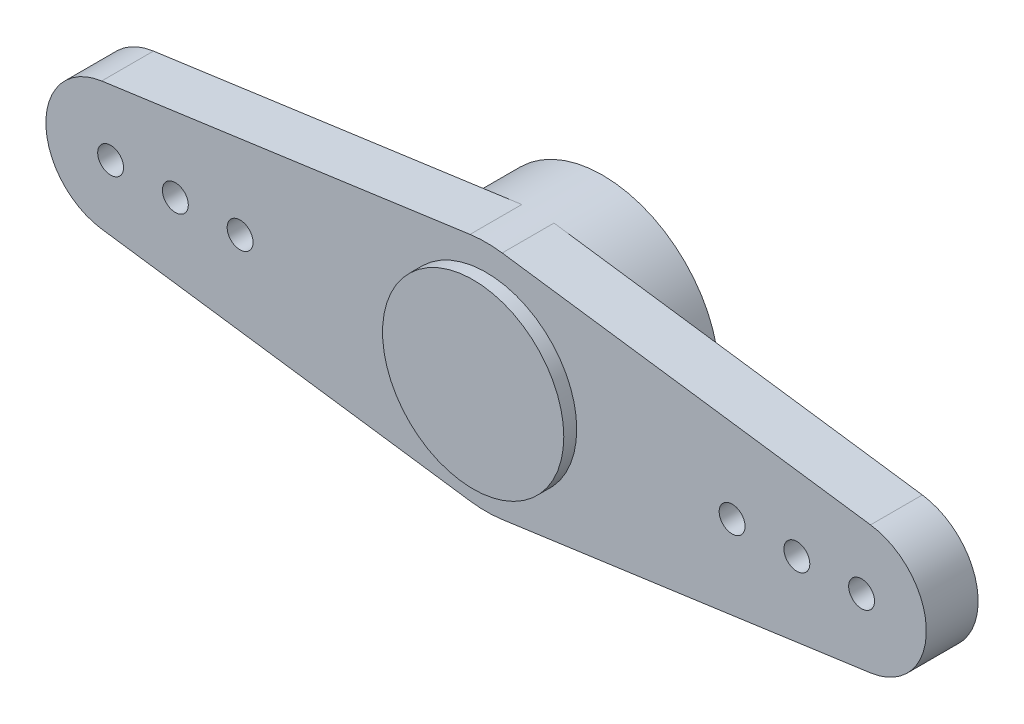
ISO-10303-21;
HEADER;
FILE_DESCRIPTION(('STEP AP214'),'2;1');
FILE_NAME('part.step','',(''),(''),'','','');
FILE_SCHEMA(('AUTOMOTIVE_DESIGN { 1 0 10303 214 1 1 1 1 }'));
ENDSEC;
DATA;
#1=APPLICATION_CONTEXT('core data for automotive mechanical design processes');
#2=APPLICATION_PROTOCOL_DEFINITION('international standard','automotive_design',2000,#1);
#3=PRODUCT_CONTEXT('',#1,'mechanical');
#4=PRODUCT('Part','Part','',(#3));
#5=PRODUCT_RELATED_PRODUCT_CATEGORY('part','',(#4));
#6=PRODUCT_DEFINITION_FORMATION('','',#4);
#7=PRODUCT_DEFINITION_CONTEXT('part definition',#1,'design');
#8=PRODUCT_DEFINITION('design','',#6,#7);
#9=PRODUCT_DEFINITION_SHAPE('','',#8);
#10=(LENGTH_UNIT() NAMED_UNIT(*) SI_UNIT(.MILLI.,.METRE.));
#11=(NAMED_UNIT(*) PLANE_ANGLE_UNIT() SI_UNIT($,.RADIAN.));
#12=(NAMED_UNIT(*) SI_UNIT($,.STERADIAN.) SOLID_ANGLE_UNIT());
#13=UNCERTAINTY_MEASURE_WITH_UNIT(LENGTH_MEASURE(1.E-05),#10,'distance_accuracy_value','');
#14=(GEOMETRIC_REPRESENTATION_CONTEXT(3) GLOBAL_UNCERTAINTY_ASSIGNED_CONTEXT((#13)) GLOBAL_UNIT_ASSIGNED_CONTEXT((#10,
#11,#12)) REPRESENTATION_CONTEXT('',''));
#15=CARTESIAN_POINT('',(0.,0.,0.));
#16=DIRECTION('',(0.,0.,1.));
#17=DIRECTION('',(1.,0.,0.));
#18=AXIS2_PLACEMENT_3D('',#15,#16,#17);
#19=CARTESIAN_POINT('',(0.,0.,0.));
#20=DIRECTION('',(0.,0.,1.));
#21=DIRECTION('',(1.,0.,0.));
#22=AXIS2_PLACEMENT_3D('',#19,#20,#21);
#23=PLANE('',#22);
#24=CARTESIAN_POINT('',(14.5,0.,0.));
#25=DIRECTION('',(0.,0.,1.));
#26=DIRECTION('',(1.,0.,0.));
#27=AXIS2_PLACEMENT_3D('',#24,#25,#26);
#28=CIRCLE('',#27,0.500000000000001);
#29=CARTESIAN_POINT('',(15.,0.,0.));
#30=VERTEX_POINT('',#29);
#31=EDGE_CURVE('E426',#30,#30,#28,.T.);
#32=ORIENTED_EDGE('',*,*,#31,.T.);
#33=EDGE_LOOP('',(#32));
#34=FACE_BOUND('',#33,.T.);
#35=CARTESIAN_POINT('',(9.5,0.,0.));
#36=DIRECTION('',(0.,0.,1.));
#37=DIRECTION('',(1.,0.,0.));
#38=AXIS2_PLACEMENT_3D('',#35,#36,#37);
#39=CIRCLE('',#38,0.500000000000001);
#40=CARTESIAN_POINT('',(10.,0.,0.));
#41=VERTEX_POINT('',#40);
#42=EDGE_CURVE('E437',#41,#41,#39,.T.);
#43=ORIENTED_EDGE('',*,*,#42,.T.);
#44=EDGE_LOOP('',(#43));
#45=FACE_BOUND('',#44,.T.);
#46=CARTESIAN_POINT('',(12.,0.,0.));
#47=DIRECTION('',(0.,0.,1.));
#48=DIRECTION('',(1.,0.,0.));
#49=AXIS2_PLACEMENT_3D('',#46,#47,#48);
#50=CIRCLE('',#49,0.500000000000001);
#51=CARTESIAN_POINT('',(12.5,0.,0.));
#52=VERTEX_POINT('',#51);
#53=EDGE_CURVE('E432',#52,#52,#50,.T.);
#54=ORIENTED_EDGE('',*,*,#53,.T.);
#55=EDGE_LOOP('',(#54));
#56=FACE_BOUND('',#55,.T.);
#57=CARTESIAN_POINT('',(0.,0.,0.));
#58=DIRECTION('',(0.,0.,-1.));
#59=DIRECTION('',(-1.,0.,0.));
#60=AXIS2_PLACEMENT_3D('',#57,#58,#59);
#61=CIRCLE('',#60,4.5);
#62=CARTESIAN_POINT('',(0.620689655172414,4.45698826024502,0.));
#63=VERTEX_POINT('',#62);
#64=CARTESIAN_POINT('',(0.620689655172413,-4.45698826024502,0.));
#65=VERTEX_POINT('',#64);
#66=EDGE_CURVE('E11',#63,#65,#61,.T.);
#67=ORIENTED_EDGE('',*,*,#66,.F.);
#68=DIRECTION('',(-0.990441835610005,0.137931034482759,0.));
#69=VECTOR('',#68,1.);
#70=CARTESIAN_POINT('',(0.620689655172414,4.45698826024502,0.));
#71=LINE('',#70,#69);
#72=CARTESIAN_POINT('',(14.8448275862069,2.47610458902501,0.));
#73=VERTEX_POINT('',#72);
#74=EDGE_CURVE('E136',#73,#63,#71,.T.);
#75=ORIENTED_EDGE('',*,*,#74,.F.);
#76=CARTESIAN_POINT('',(14.5,0.,0.));
#77=DIRECTION('',(0.,0.,1.));
#78=DIRECTION('',(1.,0.,0.));
#79=AXIS2_PLACEMENT_3D('',#76,#77,#78);
#80=CIRCLE('',#79,2.5);
#81=CARTESIAN_POINT('',(14.8448275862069,-2.47610458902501,0.));
#82=VERTEX_POINT('',#81);
#83=EDGE_CURVE('E134',#82,#73,#80,.T.);
#84=ORIENTED_EDGE('',*,*,#83,.F.);
#85=DIRECTION('',(0.990441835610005,0.137931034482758,0.));
#86=VECTOR('',#85,1.);
#87=CARTESIAN_POINT('',(14.8448275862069,-2.47610458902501,0.));
#88=LINE('',#87,#86);
#89=EDGE_CURVE('E137',#65,#82,#88,.T.);
#90=ORIENTED_EDGE('',*,*,#89,.F.);
#91=EDGE_LOOP('',(#67,#75,#84,#90));
#92=FACE_BOUND('',#91,.T.);
#93=ADVANCED_FACE('F34',(#34,#45,#56,#92),#23,.F.);
#94=CARTESIAN_POINT('',(-12.,0.,0.));
#95=DIRECTION('',(0.,0.,1.));
#96=DIRECTION('',(1.,0.,0.));
#97=AXIS2_PLACEMENT_3D('',#94,#95,#96);
#98=CIRCLE('',#97,0.500000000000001);
#99=CARTESIAN_POINT('',(-11.5,0.,0.));
#100=VERTEX_POINT('',#99);
#101=EDGE_CURVE('E196',#100,#100,#98,.T.);
#102=ORIENTED_EDGE('',*,*,#101,.T.);
#103=EDGE_LOOP('',(#102));
#104=FACE_BOUND('',#103,.T.);
#105=CARTESIAN_POINT('',(-14.5,0.,0.));
#106=DIRECTION('',(0.,0.,1.));
#107=DIRECTION('',(1.,0.,0.));
#108=AXIS2_PLACEMENT_3D('',#105,#106,#107);
#109=CIRCLE('',#108,0.500000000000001);
#110=CARTESIAN_POINT('',(-14.,0.,0.));
#111=VERTEX_POINT('',#110);
#112=EDGE_CURVE('E188',#111,#111,#109,.T.);
#113=ORIENTED_EDGE('',*,*,#112,.T.);
#114=EDGE_LOOP('',(#113));
#115=FACE_BOUND('',#114,.T.);
#116=CARTESIAN_POINT('',(-9.5,0.,0.));
#117=DIRECTION('',(0.,0.,1.));
#118=DIRECTION('',(1.,0.,0.));
#119=AXIS2_PLACEMENT_3D('',#116,#117,#118);
#120=CIRCLE('',#119,0.500000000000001);
#121=CARTESIAN_POINT('',(-9.,0.,0.));
#122=VERTEX_POINT('',#121);
#123=EDGE_CURVE('E443',#122,#122,#120,.T.);
#124=ORIENTED_EDGE('',*,*,#123,.T.);
#125=EDGE_LOOP('',(#124));
#126=FACE_BOUND('',#125,.T.);
#127=CARTESIAN_POINT('',(-0.620689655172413,-4.45698826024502,0.));
#128=VERTEX_POINT('',#127);
#129=CARTESIAN_POINT('',(-0.620689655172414,4.45698826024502,0.));
#130=VERTEX_POINT('',#129);
#131=EDGE_CURVE('E44',#128,#130,#61,.T.);
#132=ORIENTED_EDGE('',*,*,#131,.F.);
#133=DIRECTION('',(0.990441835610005,-0.137931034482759,0.));
#134=VECTOR('',#133,1.);
#135=CARTESIAN_POINT('',(-14.8448275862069,-2.47610458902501,0.));
#136=LINE('',#135,#134);
#137=CARTESIAN_POINT('',(-14.8448275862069,-2.47610458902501,0.));
#138=VERTEX_POINT('',#137);
#139=EDGE_CURVE('E139',#138,#128,#136,.T.);
#140=ORIENTED_EDGE('',*,*,#139,.F.);
#141=CARTESIAN_POINT('',(-14.5,0.,0.));
#142=DIRECTION('',(0.,0.,1.));
#143=DIRECTION('',(1.,0.,0.));
#144=AXIS2_PLACEMENT_3D('',#141,#142,#143);
#145=CIRCLE('',#144,2.5);
#146=CARTESIAN_POINT('',(-14.8448275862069,2.47610458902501,0.));
#147=VERTEX_POINT('',#146);
#148=EDGE_CURVE('E80',#147,#138,#145,.T.);
#149=ORIENTED_EDGE('',*,*,#148,.F.);
#150=DIRECTION('',(-0.990441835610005,-0.137931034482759,0.));
#151=VECTOR('',#150,1.);
#152=CARTESIAN_POINT('',(-14.8448275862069,2.47610458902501,0.));
#153=LINE('',#152,#151);
#154=EDGE_CURVE('E124',#130,#147,#153,.T.);
#155=ORIENTED_EDGE('',*,*,#154,.F.);
#156=EDGE_LOOP('',(#132,#140,#149,#155));
#157=FACE_BOUND('',#156,.T.);
#158=ADVANCED_FACE('F174',(#104,#115,#126,#157),#23,.F.);
#159=CARTESIAN_POINT('',(0.,0.,2.));
#160=DIRECTION('',(0.,0.,1.));
#161=DIRECTION('',(1.,0.,0.));
#162=AXIS2_PLACEMENT_3D('',#159,#160,#161);
#163=PLANE('',#162);
#164=CARTESIAN_POINT('',(14.5,0.,2.));
#165=DIRECTION('',(0.,0.,1.));
#166=DIRECTION('',(1.,0.,0.));
#167=AXIS2_PLACEMENT_3D('',#164,#165,#166);
#168=CIRCLE('',#167,0.500000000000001);
#169=CARTESIAN_POINT('',(15.,0.,2.));
#170=VERTEX_POINT('',#169);
#171=EDGE_CURVE('E429',#170,#170,#168,.T.);
#172=ORIENTED_EDGE('',*,*,#171,.F.);
#173=EDGE_LOOP('',(#172));
#174=FACE_BOUND('',#173,.T.);
#175=CARTESIAN_POINT('',(9.5,0.,2.));
#176=DIRECTION('',(0.,0.,1.));
#177=DIRECTION('',(1.,0.,0.));
#178=AXIS2_PLACEMENT_3D('',#175,#176,#177);
#179=CIRCLE('',#178,0.500000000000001);
#180=CARTESIAN_POINT('',(10.,0.,2.));
#181=VERTEX_POINT('',#180);
#182=EDGE_CURVE('E440',#181,#181,#179,.T.);
#183=ORIENTED_EDGE('',*,*,#182,.F.);
#184=EDGE_LOOP('',(#183));
#185=FACE_BOUND('',#184,.T.);
#186=CARTESIAN_POINT('',(-12.,0.,2.));
#187=DIRECTION('',(0.,0.,1.));
#188=DIRECTION('',(1.,0.,0.));
#189=AXIS2_PLACEMENT_3D('',#186,#187,#188);
#190=CIRCLE('',#189,0.500000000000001);
#191=CARTESIAN_POINT('',(-11.5,0.,2.));
#192=VERTEX_POINT('',#191);
#193=EDGE_CURVE('E193',#192,#192,#190,.T.);
#194=ORIENTED_EDGE('',*,*,#193,.F.);
#195=EDGE_LOOP('',(#194));
#196=FACE_BOUND('',#195,.T.);
#197=CARTESIAN_POINT('',(0.,0.,2.));
#198=DIRECTION('',(0.,0.,1.));
#199=DIRECTION('',(1.,0.,0.));
#200=AXIS2_PLACEMENT_3D('',#197,#198,#199);
#201=CIRCLE('',#200,4.5);
#202=CARTESIAN_POINT('',(-0.620689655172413,-4.45698826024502,2.));
#203=VERTEX_POINT('',#202);
#204=CARTESIAN_POINT('',(0.620689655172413,-4.45698826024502,2.));
#205=VERTEX_POINT('',#204);
#206=EDGE_CURVE('E161',#203,#205,#201,.T.);
#207=ORIENTED_EDGE('',*,*,#206,.T.);
#208=DIRECTION('',(0.990441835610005,0.137931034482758,0.));
#209=VECTOR('',#208,1.);
#210=CARTESIAN_POINT('',(14.8448275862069,-2.47610458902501,2.));
#211=LINE('',#210,#209);
#212=CARTESIAN_POINT('',(14.8448275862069,-2.47610458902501,2.));
#213=VERTEX_POINT('',#212);
#214=EDGE_CURVE('E96',#205,#213,#211,.T.);
#215=ORIENTED_EDGE('',*,*,#214,.T.);
#216=CARTESIAN_POINT('',(14.5,0.,2.));
#217=DIRECTION('',(0.,0.,1.));
#218=DIRECTION('',(1.,0.,0.));
#219=AXIS2_PLACEMENT_3D('',#216,#217,#218);
#220=CIRCLE('',#219,2.5);
#221=CARTESIAN_POINT('',(14.8448275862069,2.47610458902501,2.));
#222=VERTEX_POINT('',#221);
#223=EDGE_CURVE('E201',#213,#222,#220,.T.);
#224=ORIENTED_EDGE('',*,*,#223,.T.);
#225=DIRECTION('',(-0.990441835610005,0.137931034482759,0.));
#226=VECTOR('',#225,1.);
#227=CARTESIAN_POINT('',(0.620689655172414,4.45698826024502,2.));
#228=LINE('',#227,#226);
#229=CARTESIAN_POINT('',(0.620689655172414,4.45698826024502,2.));
#230=VERTEX_POINT('',#229);
#231=EDGE_CURVE('E203',#222,#230,#228,.T.);
#232=ORIENTED_EDGE('',*,*,#231,.T.);
#233=CARTESIAN_POINT('',(0.,0.,2.));
#234=DIRECTION('',(0.,0.,1.));
#235=DIRECTION('',(1.,0.,0.));
#236=AXIS2_PLACEMENT_3D('',#233,#234,#235);
#237=CIRCLE('',#236,4.5);
#238=CARTESIAN_POINT('',(-0.620689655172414,4.45698826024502,2.));
#239=VERTEX_POINT('',#238);
#240=EDGE_CURVE('E117',#230,#239,#237,.T.);
#241=ORIENTED_EDGE('',*,*,#240,.T.);
#242=DIRECTION('',(-0.990441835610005,-0.137931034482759,0.));
#243=VECTOR('',#242,1.);
#244=CARTESIAN_POINT('',(-14.8448275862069,2.47610458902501,2.));
#245=LINE('',#244,#243);
#246=CARTESIAN_POINT('',(-14.8448275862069,2.47610458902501,2.));
#247=VERTEX_POINT('',#246);
#248=EDGE_CURVE('E110',#239,#247,#245,.T.);
#249=ORIENTED_EDGE('',*,*,#248,.T.);
#250=CARTESIAN_POINT('',(-14.5,0.,2.));
#251=DIRECTION('',(0.,0.,1.));
#252=DIRECTION('',(1.,0.,0.));
#253=AXIS2_PLACEMENT_3D('',#250,#251,#252);
#254=CIRCLE('',#253,2.5);
#255=CARTESIAN_POINT('',(-14.8448275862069,-2.47610458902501,2.));
#256=VERTEX_POINT('',#255);
#257=EDGE_CURVE('E115',#247,#256,#254,.T.);
#258=ORIENTED_EDGE('',*,*,#257,.T.);
#259=DIRECTION('',(0.990441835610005,-0.137931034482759,0.));
#260=VECTOR('',#259,1.);
#261=CARTESIAN_POINT('',(-14.8448275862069,-2.47610458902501,2.));
#262=LINE('',#261,#260);
#263=EDGE_CURVE('E53',#256,#203,#262,.T.);
#264=ORIENTED_EDGE('',*,*,#263,.T.);
#265=EDGE_LOOP('',(#207,#215,#224,#232,#241,#249,#258,#264));
#266=FACE_BOUND('',#265,.T.);
#267=CARTESIAN_POINT('',(-14.5,0.,2.));
#268=DIRECTION('',(0.,0.,1.));
#269=DIRECTION('',(1.,0.,0.));
#270=AXIS2_PLACEMENT_3D('',#267,#268,#269);
#271=CIRCLE('',#270,0.500000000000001);
#272=CARTESIAN_POINT('',(-14.,0.,2.));
#273=VERTEX_POINT('',#272);
#274=EDGE_CURVE('E186',#273,#273,#271,.T.);
#275=ORIENTED_EDGE('',*,*,#274,.F.);
#276=EDGE_LOOP('',(#275));
#277=FACE_BOUND('',#276,.T.);
#278=CARTESIAN_POINT('',(-9.5,0.,2.));
#279=DIRECTION('',(0.,0.,1.));
#280=DIRECTION('',(1.,0.,0.));
#281=AXIS2_PLACEMENT_3D('',#278,#279,#280);
#282=CIRCLE('',#281,0.500000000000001);
#283=CARTESIAN_POINT('',(-9.,0.,2.));
#284=VERTEX_POINT('',#283);
#285=EDGE_CURVE('E446',#284,#284,#282,.T.);
#286=ORIENTED_EDGE('',*,*,#285,.F.);
#287=EDGE_LOOP('',(#286));
#288=FACE_BOUND('',#287,.T.);
#289=CARTESIAN_POINT('',(12.,0.,2.));
#290=DIRECTION('',(0.,0.,1.));
#291=DIRECTION('',(1.,0.,0.));
#292=AXIS2_PLACEMENT_3D('',#289,#290,#291);
#293=CIRCLE('',#292,0.500000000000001);
#294=CARTESIAN_POINT('',(12.5,0.,2.));
#295=VERTEX_POINT('',#294);
#296=EDGE_CURVE('E434',#295,#295,#293,.T.);
#297=ORIENTED_EDGE('',*,*,#296,.F.);
#298=EDGE_LOOP('',(#297));
#299=FACE_BOUND('',#298,.T.);
#300=CARTESIAN_POINT('',(0.,0.,2.));
#301=DIRECTION('',(0.,0.,1.));
#302=DIRECTION('',(1.,0.,0.));
#303=AXIS2_PLACEMENT_3D('',#300,#301,#302);
#304=CIRCLE('',#303,3.5);
#305=CARTESIAN_POINT('',(3.5,0.,2.));
#306=VERTEX_POINT('',#305);
#307=EDGE_CURVE('E418',#306,#306,#304,.T.);
#308=ORIENTED_EDGE('',*,*,#307,.F.);
#309=EDGE_LOOP('',(#308));
#310=FACE_BOUND('',#309,.T.);
#311=ADVANCED_FACE('F112',(#174,#185,#196,#266,#277,#288,#299,#310),#163,.T.);
#312=CARTESIAN_POINT('',(14.8448275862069,-2.47610458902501,2.));
#313=DIRECTION('',(-0.137931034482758,0.990441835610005,0.));
#314=DIRECTION('',(-0.990441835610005,-0.137931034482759,0.));
#315=AXIS2_PLACEMENT_3D('',#312,#313,#314);
#316=PLANE('',#315);
#317=ORIENTED_EDGE('',*,*,#89,.T.);
#318=DIRECTION('',(0.,0.,-1.));
#319=VECTOR('',#318,1.);
#320=CARTESIAN_POINT('',(14.8448275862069,-2.47610458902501,2.));
#321=LINE('',#320,#319);
#322=EDGE_CURVE('E144',#213,#82,#321,.T.);
#323=ORIENTED_EDGE('',*,*,#322,.F.);
#324=ORIENTED_EDGE('',*,*,#214,.F.);
#325=DIRECTION('',(0.,0.,-1.));
#326=VECTOR('',#325,1.);
#327=CARTESIAN_POINT('',(0.620689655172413,-4.45698826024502,2.));
#328=LINE('',#327,#326);
#329=EDGE_CURVE('E148',#205,#65,#328,.T.);
#330=ORIENTED_EDGE('',*,*,#329,.T.);
#331=EDGE_LOOP('',(#317,#323,#324,#330));
#332=FACE_BOUND('',#331,.T.);
#333=ADVANCED_FACE('F36',(#332),#316,.F.);
#334=CARTESIAN_POINT('',(14.5,0.,2.));
#335=DIRECTION('',(0.,0.,-1.));
#336=DIRECTION('',(-1.,0.,0.));
#337=AXIS2_PLACEMENT_3D('',#334,#335,#336);
#338=CYLINDRICAL_SURFACE('',#337,2.5);
#339=ORIENTED_EDGE('',*,*,#83,.T.);
#340=DIRECTION('',(0.,0.,-1.));
#341=VECTOR('',#340,1.);
#342=CARTESIAN_POINT('',(14.8448275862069,2.47610458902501,2.));
#343=LINE('',#342,#341);
#344=EDGE_CURVE('E141',#222,#73,#343,.T.);
#345=ORIENTED_EDGE('',*,*,#344,.F.);
#346=ORIENTED_EDGE('',*,*,#223,.F.);
#347=ORIENTED_EDGE('',*,*,#322,.T.);
#348=EDGE_LOOP('',(#339,#345,#346,#347));
#349=FACE_BOUND('',#348,.T.);
#350=ADVANCED_FACE('F213',(#349),#338,.T.);
#351=CARTESIAN_POINT('',(0.620689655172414,4.45698826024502,2.));
#352=DIRECTION('',(-0.137931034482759,-0.990441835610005,0.));
#353=DIRECTION('',(0.990441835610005,-0.137931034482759,0.));
#354=AXIS2_PLACEMENT_3D('',#351,#352,#353);
#355=PLANE('',#354);
#356=ORIENTED_EDGE('',*,*,#74,.T.);
#357=DIRECTION('',(0.,0.,-1.));
#358=VECTOR('',#357,1.);
#359=CARTESIAN_POINT('',(0.620689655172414,4.45698826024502,2.));
#360=LINE('',#359,#358);
#361=EDGE_CURVE('E145',#230,#63,#360,.T.);
#362=ORIENTED_EDGE('',*,*,#361,.F.);
#363=ORIENTED_EDGE('',*,*,#231,.F.);
#364=ORIENTED_EDGE('',*,*,#344,.T.);
#365=EDGE_LOOP('',(#356,#362,#363,#364));
#366=FACE_BOUND('',#365,.T.);
#367=ADVANCED_FACE('F208',(#366),#355,.F.);
#368=CARTESIAN_POINT('',(0.,0.,2.));
#369=DIRECTION('',(0.,0.,-1.));
#370=DIRECTION('',(-1.,0.,0.));
#371=AXIS2_PLACEMENT_3D('',#368,#369,#370);
#372=CYLINDRICAL_SURFACE('',#371,4.5);
#373=ORIENTED_EDGE('',*,*,#361,.T.);
#374=ORIENTED_EDGE('',*,*,#66,.T.);
#375=ORIENTED_EDGE('',*,*,#329,.F.);
#376=ORIENTED_EDGE('',*,*,#206,.F.);
#377=DIRECTION('',(0.,0.,-1.));
#378=VECTOR('',#377,1.);
#379=CARTESIAN_POINT('',(-0.620689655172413,-4.45698826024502,2.));
#380=LINE('',#379,#378);
#381=EDGE_CURVE('E130',#203,#128,#380,.T.);
#382=ORIENTED_EDGE('',*,*,#381,.T.);
#383=ORIENTED_EDGE('',*,*,#131,.T.);
#384=DIRECTION('',(0.,0.,-1.));
#385=VECTOR('',#384,1.);
#386=CARTESIAN_POINT('',(-0.620689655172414,4.45698826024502,2.));
#387=LINE('',#386,#385);
#388=EDGE_CURVE('E125',#239,#130,#387,.T.);
#389=ORIENTED_EDGE('',*,*,#388,.F.);
#390=ORIENTED_EDGE('',*,*,#240,.F.);
#391=EDGE_LOOP('',(#373,#374,#375,#376,#382,#383,#389,#390));
#392=FACE_BOUND('',#391,.T.);
#393=CARTESIAN_POINT('',(0.,0.,-2.5));
#394=DIRECTION('',(0.,0.,-1.));
#395=DIRECTION('',(-1.,0.,0.));
#396=AXIS2_PLACEMENT_3D('',#393,#394,#395);
#397=CIRCLE('',#396,4.5);
#398=CARTESIAN_POINT('',(-4.5,0.,-2.5));
#399=VERTEX_POINT('',#398);
#400=EDGE_CURVE('E414',#399,#399,#397,.T.);
#401=ORIENTED_EDGE('',*,*,#400,.F.);
#402=EDGE_LOOP('',(#401));
#403=FACE_BOUND('',#402,.T.);
#404=ADVANCED_FACE('F169',(#392,#403),#372,.T.);
#405=CARTESIAN_POINT('',(-14.8448275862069,2.47610458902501,2.));
#406=DIRECTION('',(0.137931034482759,-0.990441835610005,0.));
#407=DIRECTION('',(0.990441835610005,0.137931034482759,0.));
#408=AXIS2_PLACEMENT_3D('',#405,#406,#407);
#409=PLANE('',#408);
#410=ORIENTED_EDGE('',*,*,#154,.T.);
#411=DIRECTION('',(0.,0.,-1.));
#412=VECTOR('',#411,1.);
#413=CARTESIAN_POINT('',(-14.8448275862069,2.47610458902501,2.));
#414=LINE('',#413,#412);
#415=EDGE_CURVE('E122',#247,#147,#414,.T.);
#416=ORIENTED_EDGE('',*,*,#415,.F.);
#417=ORIENTED_EDGE('',*,*,#248,.F.);
#418=ORIENTED_EDGE('',*,*,#388,.T.);
#419=EDGE_LOOP('',(#410,#416,#417,#418));
#420=FACE_BOUND('',#419,.T.);
#421=ADVANCED_FACE('F123',(#420),#409,.F.);
#422=CARTESIAN_POINT('',(-14.5,0.,2.));
#423=DIRECTION('',(0.,0.,-1.));
#424=DIRECTION('',(-1.,0.,0.));
#425=AXIS2_PLACEMENT_3D('',#422,#423,#424);
#426=CYLINDRICAL_SURFACE('',#425,2.5);
#427=ORIENTED_EDGE('',*,*,#148,.T.);
#428=DIRECTION('',(0.,0.,-1.));
#429=VECTOR('',#428,1.);
#430=CARTESIAN_POINT('',(-14.8448275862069,-2.47610458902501,2.));
#431=LINE('',#430,#429);
#432=EDGE_CURVE('E126',#256,#138,#431,.T.);
#433=ORIENTED_EDGE('',*,*,#432,.F.);
#434=ORIENTED_EDGE('',*,*,#257,.F.);
#435=ORIENTED_EDGE('',*,*,#415,.T.);
#436=EDGE_LOOP('',(#427,#433,#434,#435));
#437=FACE_BOUND('',#436,.T.);
#438=ADVANCED_FACE('F128',(#437),#426,.T.);
#439=CARTESIAN_POINT('',(-14.8448275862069,-2.47610458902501,2.));
#440=DIRECTION('',(0.137931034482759,0.990441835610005,0.));
#441=DIRECTION('',(-0.990441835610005,0.137931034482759,0.));
#442=AXIS2_PLACEMENT_3D('',#439,#440,#441);
#443=PLANE('',#442);
#444=ORIENTED_EDGE('',*,*,#139,.T.);
#445=ORIENTED_EDGE('',*,*,#381,.F.);
#446=ORIENTED_EDGE('',*,*,#263,.F.);
#447=ORIENTED_EDGE('',*,*,#432,.T.);
#448=EDGE_LOOP('',(#444,#445,#446,#447));
#449=FACE_BOUND('',#448,.T.);
#450=ADVANCED_FACE('F173',(#449),#443,.F.);
#451=CARTESIAN_POINT('',(-14.5,0.,2.));
#452=DIRECTION('',(0.,0.,-1.));
#453=DIRECTION('',(-1.,0.,0.));
#454=AXIS2_PLACEMENT_3D('',#451,#452,#453);
#455=CYLINDRICAL_SURFACE('',#454,0.500000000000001);
#456=ORIENTED_EDGE('',*,*,#274,.T.);
#457=EDGE_LOOP('',(#456));
#458=FACE_BOUND('',#457,.T.);
#459=ORIENTED_EDGE('',*,*,#112,.F.);
#460=EDGE_LOOP('',(#459));
#461=FACE_BOUND('',#460,.T.);
#462=ADVANCED_FACE('F234',(#458,#461),#455,.F.);
#463=CARTESIAN_POINT('',(-12.,0.,2.));
#464=DIRECTION('',(0.,0.,-1.));
#465=DIRECTION('',(-1.,0.,0.));
#466=AXIS2_PLACEMENT_3D('',#463,#464,#465);
#467=CYLINDRICAL_SURFACE('',#466,0.500000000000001);
#468=ORIENTED_EDGE('',*,*,#193,.T.);
#469=EDGE_LOOP('',(#468));
#470=FACE_BOUND('',#469,.T.);
#471=ORIENTED_EDGE('',*,*,#101,.F.);
#472=EDGE_LOOP('',(#471));
#473=FACE_BOUND('',#472,.T.);
#474=ADVANCED_FACE('F269',(#470,#473),#467,.F.);
#475=CARTESIAN_POINT('',(-9.5,0.,2.));
#476=DIRECTION('',(0.,0.,-1.));
#477=DIRECTION('',(-1.,0.,0.));
#478=AXIS2_PLACEMENT_3D('',#475,#476,#477);
#479=CYLINDRICAL_SURFACE('',#478,0.500000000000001);
#480=ORIENTED_EDGE('',*,*,#285,.T.);
#481=EDGE_LOOP('',(#480));
#482=FACE_BOUND('',#481,.T.);
#483=ORIENTED_EDGE('',*,*,#123,.F.);
#484=EDGE_LOOP('',(#483));
#485=FACE_BOUND('',#484,.T.);
#486=ADVANCED_FACE('F275',(#482,#485),#479,.F.);
#487=CARTESIAN_POINT('',(9.5,0.,2.));
#488=DIRECTION('',(0.,0.,-1.));
#489=DIRECTION('',(-1.,0.,0.));
#490=AXIS2_PLACEMENT_3D('',#487,#488,#489);
#491=CYLINDRICAL_SURFACE('',#490,0.500000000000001);
#492=ORIENTED_EDGE('',*,*,#182,.T.);
#493=EDGE_LOOP('',(#492));
#494=FACE_BOUND('',#493,.T.);
#495=ORIENTED_EDGE('',*,*,#42,.F.);
#496=EDGE_LOOP('',(#495));
#497=FACE_BOUND('',#496,.T.);
#498=ADVANCED_FACE('F283',(#494,#497),#491,.F.);
#499=CARTESIAN_POINT('',(12.,0.,2.));
#500=DIRECTION('',(0.,0.,-1.));
#501=DIRECTION('',(-1.,0.,0.));
#502=AXIS2_PLACEMENT_3D('',#499,#500,#501);
#503=CYLINDRICAL_SURFACE('',#502,0.500000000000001);
#504=ORIENTED_EDGE('',*,*,#296,.T.);
#505=EDGE_LOOP('',(#504));
#506=FACE_BOUND('',#505,.T.);
#507=ORIENTED_EDGE('',*,*,#53,.F.);
#508=EDGE_LOOP('',(#507));
#509=FACE_BOUND('',#508,.T.);
#510=ADVANCED_FACE('F291',(#506,#509),#503,.F.);
#511=CARTESIAN_POINT('',(14.5,0.,2.));
#512=DIRECTION('',(0.,0.,-1.));
#513=DIRECTION('',(-1.,0.,0.));
#514=AXIS2_PLACEMENT_3D('',#511,#512,#513);
#515=CYLINDRICAL_SURFACE('',#514,0.500000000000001);
#516=ORIENTED_EDGE('',*,*,#171,.T.);
#517=EDGE_LOOP('',(#516));
#518=FACE_BOUND('',#517,.T.);
#519=ORIENTED_EDGE('',*,*,#31,.F.);
#520=EDGE_LOOP('',(#519));
#521=FACE_BOUND('',#520,.T.);
#522=ADVANCED_FACE('F299',(#518,#521),#515,.F.);
#523=CARTESIAN_POINT('',(0.,0.,2.5));
#524=DIRECTION('',(0.,0.,-1.));
#525=DIRECTION('',(-1.,0.,0.));
#526=AXIS2_PLACEMENT_3D('',#523,#524,#525);
#527=CYLINDRICAL_SURFACE('',#526,3.5);
#528=CARTESIAN_POINT('',(0.,0.,2.5));
#529=DIRECTION('',(0.,0.,1.));
#530=DIRECTION('',(1.,0.,0.));
#531=AXIS2_PLACEMENT_3D('',#528,#529,#530);
#532=CIRCLE('',#531,3.5);
#533=CARTESIAN_POINT('',(3.5,0.,2.5));
#534=VERTEX_POINT('',#533);
#535=EDGE_CURVE('E423',#534,#534,#532,.T.);
#536=ORIENTED_EDGE('',*,*,#535,.F.);
#537=EDGE_LOOP('',(#536));
#538=FACE_BOUND('',#537,.T.);
#539=ORIENTED_EDGE('',*,*,#307,.T.);
#540=EDGE_LOOP('',(#539));
#541=FACE_BOUND('',#540,.T.);
#542=ADVANCED_FACE('F307',(#538,#541),#527,.T.);
#543=CARTESIAN_POINT('',(0.,0.,2.5));
#544=DIRECTION('',(0.,0.,1.));
#545=DIRECTION('',(1.,0.,0.));
#546=AXIS2_PLACEMENT_3D('',#543,#544,#545);
#547=PLANE('',#546);
#548=ORIENTED_EDGE('',*,*,#535,.T.);
#549=EDGE_LOOP('',(#548));
#550=FACE_BOUND('',#549,.T.);
#551=ADVANCED_FACE('F316',(#550),#547,.T.);
#552=CARTESIAN_POINT('',(0.,0.,-2.5));
#553=DIRECTION('',(0.,0.,-1.));
#554=DIRECTION('',(-1.,0.,0.));
#555=AXIS2_PLACEMENT_3D('',#552,#553,#554);
#556=PLANE('',#555);
#557=CARTESIAN_POINT('',(0.,0.,-2.5));
#558=DIRECTION('',(0.,0.,-1.));
#559=DIRECTION('',(-1.,0.,0.));
#560=AXIS2_PLACEMENT_3D('',#557,#558,#559);
#561=CIRCLE('',#560,2.9);
#562=CARTESIAN_POINT('',(-2.9,0.,-2.5));
#563=VERTEX_POINT('',#562);
#564=EDGE_CURVE('E415',#563,#563,#561,.T.);
#565=ORIENTED_EDGE('',*,*,#564,.F.);
#566=EDGE_LOOP('',(#565));
#567=FACE_BOUND('',#566,.T.);
#568=ORIENTED_EDGE('',*,*,#400,.T.);
#569=EDGE_LOOP('',(#568));
#570=FACE_BOUND('',#569,.T.);
#571=ADVANCED_FACE('F324',(#567,#570),#556,.T.);
#572=CARTESIAN_POINT('',(0.,0.,0.2));
#573=DIRECTION('',(0.,0.,-1.));
#574=DIRECTION('',(-1.,0.,0.));
#575=AXIS2_PLACEMENT_3D('',#572,#573,#574);
#576=CYLINDRICAL_SURFACE('',#575,2.9);
#577=CARTESIAN_POINT('',(0.,0.,0.2));
#578=DIRECTION('',(0.,0.,-1.));
#579=DIRECTION('',(-1.,0.,0.));
#580=AXIS2_PLACEMENT_3D('',#577,#578,#579);
#581=CIRCLE('',#580,2.9);
#582=CARTESIAN_POINT('',(-2.9,0.,0.2));
#583=VERTEX_POINT('',#582);
#584=EDGE_CURVE('E413',#583,#583,#581,.T.);
#585=CARTESIAN_POINT('',(-2.9,0.,0.2));
#586=CARTESIAN_POINT('',(-2.9,0.,0.171875));
#587=CARTESIAN_POINT('',(-2.9,0.,0.14375));
#588=CARTESIAN_POINT('',(-2.9,0.,0.0875000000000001));
#589=CARTESIAN_POINT('',(-2.9,0.,0.0593750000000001));
#590=CARTESIAN_POINT('',(-2.9,0.,0.00312500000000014));
#591=CARTESIAN_POINT('',(-2.9,0.,-0.0249999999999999));
#592=CARTESIAN_POINT('',(-2.9,0.,-0.0812499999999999));
#593=CARTESIAN_POINT('',(-2.9,0.,-0.109375));
#594=CARTESIAN_POINT('',(-2.9,0.,-0.165625));
#595=CARTESIAN_POINT('',(-2.9,0.,-0.19375));
#596=CARTESIAN_POINT('',(-2.9,0.,-0.25));
#597=CARTESIAN_POINT('',(-2.9,0.,-0.278125));
#598=CARTESIAN_POINT('',(-2.9,0.,-0.334375));
#599=CARTESIAN_POINT('',(-2.9,0.,-0.3625));
#600=CARTESIAN_POINT('',(-2.9,0.,-0.41875));
#601=CARTESIAN_POINT('',(-2.9,0.,-0.446875));
#602=CARTESIAN_POINT('',(-2.9,0.,-0.503125));
#603=CARTESIAN_POINT('',(-2.9,0.,-0.53125));
#604=CARTESIAN_POINT('',(-2.9,0.,-0.5875));
#605=CARTESIAN_POINT('',(-2.9,0.,-0.615625));
#606=CARTESIAN_POINT('',(-2.9,0.,-0.671875));
#607=CARTESIAN_POINT('',(-2.9,0.,-0.7));
#608=CARTESIAN_POINT('',(-2.9,0.,-0.75625));
#609=CARTESIAN_POINT('',(-2.9,0.,-0.784375));
#610=CARTESIAN_POINT('',(-2.9,0.,-0.840625));
#611=CARTESIAN_POINT('',(-2.9,0.,-0.86875));
#612=CARTESIAN_POINT('',(-2.9,0.,-0.925));
#613=CARTESIAN_POINT('',(-2.9,0.,-0.953125));
#614=CARTESIAN_POINT('',(-2.9,0.,-1.009375));
#615=CARTESIAN_POINT('',(-2.9,0.,-1.0375));
#616=CARTESIAN_POINT('',(-2.9,0.,-1.09375));
#617=CARTESIAN_POINT('',(-2.9,0.,-1.121875));
#618=CARTESIAN_POINT('',(-2.9,0.,-1.178125));
#619=CARTESIAN_POINT('',(-2.9,0.,-1.20625));
#620=CARTESIAN_POINT('',(-2.9,0.,-1.2625));
#621=CARTESIAN_POINT('',(-2.9,0.,-1.290625));
#622=CARTESIAN_POINT('',(-2.9,0.,-1.346875));
#623=CARTESIAN_POINT('',(-2.9,0.,-1.375));
#624=CARTESIAN_POINT('',(-2.9,0.,-1.43125));
#625=CARTESIAN_POINT('',(-2.9,0.,-1.459375));
#626=CARTESIAN_POINT('',(-2.9,0.,-1.515625));
#627=CARTESIAN_POINT('',(-2.9,0.,-1.54375));
#628=CARTESIAN_POINT('',(-2.9,0.,-1.6));
#629=CARTESIAN_POINT('',(-2.9,0.,-1.628125));
#630=CARTESIAN_POINT('',(-2.9,0.,-1.684375));
#631=CARTESIAN_POINT('',(-2.9,0.,-1.7125));
#632=CARTESIAN_POINT('',(-2.9,0.,-1.76875));
#633=CARTESIAN_POINT('',(-2.9,0.,-1.796875));
#634=CARTESIAN_POINT('',(-2.9,0.,-1.853125));
#635=CARTESIAN_POINT('',(-2.9,0.,-1.88125));
#636=CARTESIAN_POINT('',(-2.9,0.,-1.9375));
#637=CARTESIAN_POINT('',(-2.9,0.,-1.965625));
#638=CARTESIAN_POINT('',(-2.9,0.,-2.021875));
#639=CARTESIAN_POINT('',(-2.9,0.,-2.05));
#640=CARTESIAN_POINT('',(-2.9,0.,-2.10625));
#641=CARTESIAN_POINT('',(-2.9,0.,-2.134375));
#642=CARTESIAN_POINT('',(-2.9,0.,-2.190625));
#643=CARTESIAN_POINT('',(-2.9,0.,-2.21875));
#644=CARTESIAN_POINT('',(-2.9,0.,-2.275));
#645=CARTESIAN_POINT('',(-2.9,0.,-2.303125));
#646=CARTESIAN_POINT('',(-2.9,0.,-2.359375));
#647=CARTESIAN_POINT('',(-2.9,0.,-2.3875));
#648=CARTESIAN_POINT('',(-2.9,0.,-2.44375));
#649=CARTESIAN_POINT('',(-2.9,0.,-2.471875));
#650=CARTESIAN_POINT('',(-2.9,0.,-2.5));
#651=B_SPLINE_CURVE_WITH_KNOTS('',3,(#585,#586,#587,#588,#589,#590,#591,#592,#593,#594,#595,
#596,#597,#598,#599,#600,#601,#602,#603,#604,#605,#606,#607,#608,#609,#610,#611,#612,#613,#614,
#615,#616,#617,#618,#619,#620,#621,#622,#623,#624,#625,#626,#627,#628,#629,#630,#631,#632,#633,
#634,#635,#636,#637,#638,#639,#640,#641,#642,#643,#644,#645,#646,#647,#648,#649,#650),
.UNSPECIFIED.,.F.,.F.,(4,2,2,2,2,2,2,2,2,2,2,2,2,2,2,2,2,2,2,2,2,2,2,2,2,2,2,2,2,2,2,2,4),(0.,
0.084375,0.16875,0.253125,0.3375,0.421875,0.50625,0.590625,0.675,0.759375,0.84375,0.928125,
1.0125,1.096875,1.18125,1.265625,1.35,1.434375,1.51875,1.603125,1.6875,1.771875,1.85625,
1.940625,2.025,2.109375,2.19375,2.278125,2.3625,2.446875,2.53125,2.615625,2.7),.UNSPECIFIED.);
#652=EDGE_CURVE('BSEAM331',#583,#563,#651,.T.);
#653=ORIENTED_EDGE('',*,*,#584,.F.);
#654=ORIENTED_EDGE('',*,*,#564,.T.);
#655=ORIENTED_EDGE('',*,*,#652,.T.);
#656=ORIENTED_EDGE('',*,*,#652,.F.);
#657=EDGE_LOOP('',(#653,#655,#654,#656));
#658=FACE_BOUND('',#657,.T.);
#659=ADVANCED_FACE('F331',(#658),#576,.F.);
#660=CARTESIAN_POINT('',(0.,0.,0.2));
#661=DIRECTION('',(0.,0.,-1.));
#662=DIRECTION('',(-1.,0.,0.));
#663=AXIS2_PLACEMENT_3D('',#660,#661,#662);
#664=PLANE('',#663);
#665=ORIENTED_EDGE('',*,*,#584,.T.);
#666=EDGE_LOOP('',(#665));
#667=FACE_BOUND('',#666,.T.);
#668=ADVANCED_FACE('F339',(#667),#664,.T.);
#669=CLOSED_SHELL('',(#93,#158,#311,#333,#350,#367,#404,#421,#438,#450,#462,#474,#486,#498,#510,
#522,#542,#551,#571,#659,#668));
#670=MANIFOLD_SOLID_BREP('B2',#669);
#671=ADVANCED_BREP_SHAPE_REPRESENTATION('',(#18,#670),#14);
#672=SHAPE_DEFINITION_REPRESENTATION(#9,#671);
ENDSEC;
END-ISO-10303-21;
